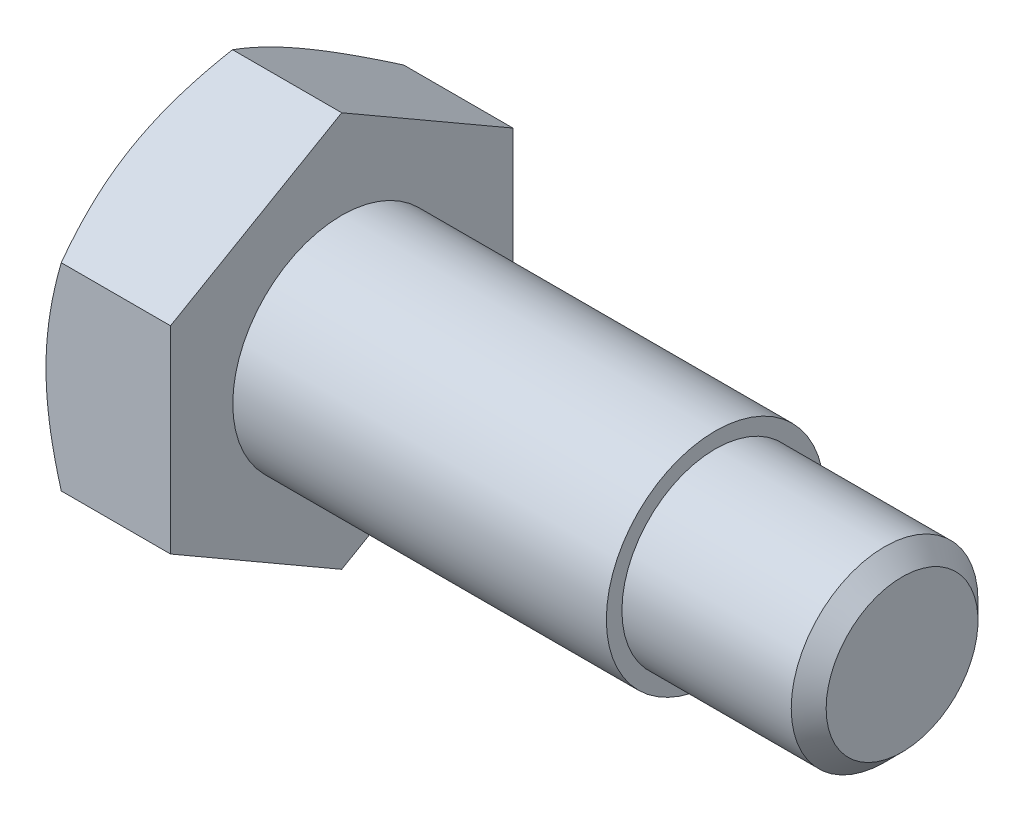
from build123d import *

# Parameters (mm, degrees)
BASEHEAD_DEPTH   = 2
ESQUISSE1_R      = 1.75
EXTRUSION1_DEPTH = 6


with BuildPart() as part:
    # Sketch1 → BaseHead (new body)
    with BuildSketch(Plane(origin=(0, 0, 0), x_dir=(0, 0, -1), z_dir=(1, 0, 0))):
        Polygon((2.75, 1.58771324), (2.75, -1.58771324), (0, -3.175426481), (-2.75, -1.58771324), (-2.75, 1.58771324), (0, 3.175426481), align=None)
    extrude(amount=BASEHEAD_DEPTH)

    # BodySke → BaseBody (revolve)
    with BuildSketch(Plane.XY, mode=Mode.PRIVATE) as basebody_sk:
        Polygon((0, 0), (11, 0), (11, 1.2195), (10.7195, 1.5), (0, 1.5), align=None)
    revolve(basebody_sk.sketch.rotate(Axis((0, 0, 0), (1, 0, 0)), 90), axis=Axis((0, 0, 0), (1, 0, 0)))

    # Sketch3 → HeadChamfer (revolve, cut)
    with BuildSketch(Plane.XY):
        Polygon((0, 2.75), (3.132371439, 8.175426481), (3.132371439, 13.175426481), (-10, 13.175426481), (-10, 2.75), align=None)
    revolve(axis=Axis((0, 0, 0), (1, 0, 0)), mode=Mode.SUBTRACT)

    # Esquisse1 → Extrusion1 (add)
    with BuildSketch(Plane(origin=(2, 0, 0), x_dir=(0, 0, -1), z_dir=(1, 0, 0))):
        Circle(ESQUISSE1_R)
    extrude(amount=EXTRUSION1_DEPTH)


solid = part.part
